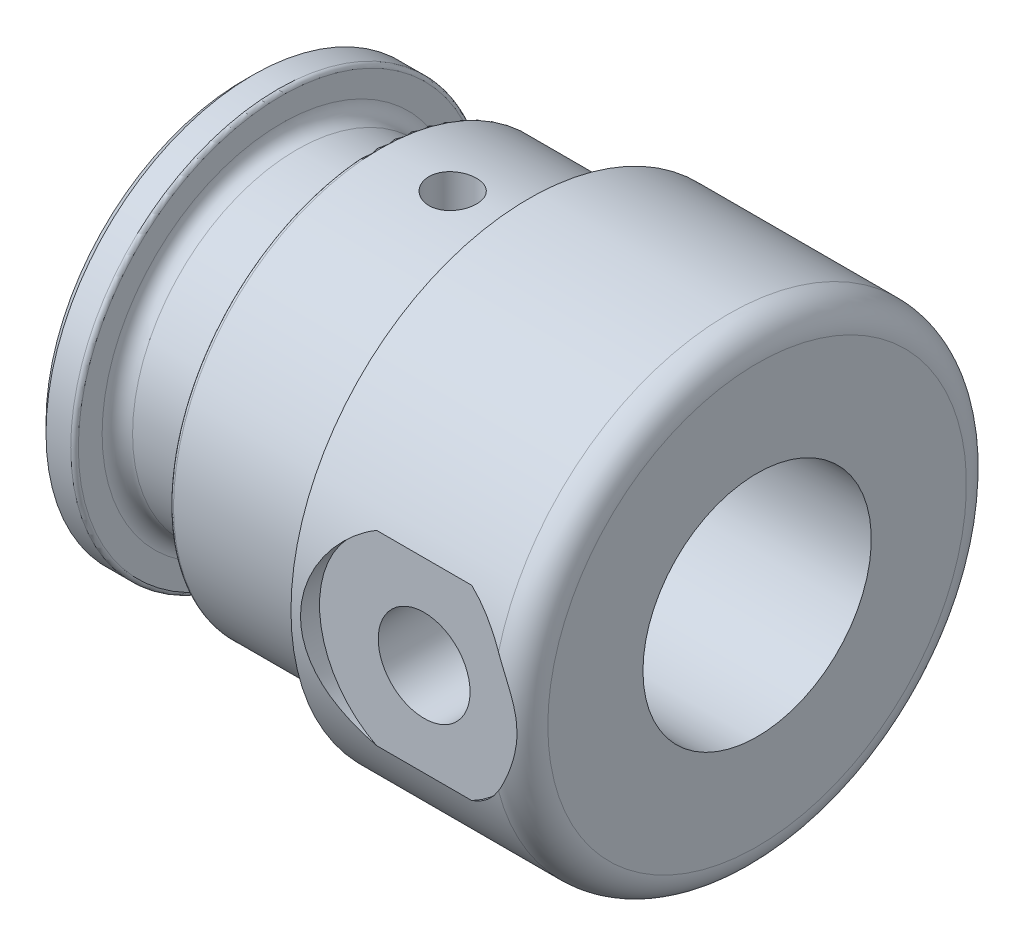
from build123d import *

# Parameters (mm, degrees)
CHAMFER1_SIZE                    = 0.5
FILLET1_R                        = 1.5
FILLET2_R                        = 0.8
FILLET3_R                        = 0.2
CIRPATTERN1_COUNT                = 2
SKETCH10_R                       = 6
CUT_EXTRUDE1_DEPTH               = 27
SKETCH11_R                       = 5.5
CUT_EXTRUDE2_DEPTH               = 1.5
F_10_32_TAPPED_HOLE1_D           = 4.0386
F_10_32_TAPPED_HOLE1_DEPTH       = 13.9624
F_10_32_TAPPED_HOLE1_CBORE_D     = 4.826
F_10_32_TAPPED_HOLE1_CBORE_DEPTH = 10
F_10_32_TAPPED_HOLE1_TIP         = 1.213317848


with BuildPart() as part:
    # Sketch1 → Base-Revolve (revolve)
    with BuildSketch(Plane.XY, mode=Mode.PRIVATE) as base_revolve_sk:
        Polygon((0, 5.55625), (0, 10.875), (2, 10.875), (2, 8.625), (7, 8.625), (7, 10.875), (15, 10.875), (15, 12.5), (27, 12.5), (27, 5.55625), align=None)
    revolve(base_revolve_sk.sketch.rotate(Axis((0, 0, 0), (1, 0, 0)), 90), axis=Axis((0, 0, 0), (1, 0, 0)))

    # Chamfer1
    chamfer1_edges = [part.edges().sort_by_distance(p)[0] for p in [
        (0, 0, -10.875),
    ]]
    chamfer(chamfer1_edges, length=CHAMFER1_SIZE)

    # Sketch8 → M3x0.5 Tapped Hole1 (revolve, cut)
    with BuildSketch(Plane(origin=(11, 11.125, 0), x_dir=(0, 0, 1), z_dir=(1, 0, 0))):
        Polygon((0, 0), (0, 4.751075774), (1.25, 4), (1.25, 0), align=None)
    m3x0_5_tapped_hole1 = revolve(axis=Axis((11, 17.475, 0), (0, -1, 0)), mode=Mode.SUBTRACT)

    # Fillet1
    fillet1_edges = [part.edges().sort_by_distance(p)[0] for p in [
        (27, 0, -12.5),
    ]]
    fillet(fillet1_edges, radius=FILLET1_R)

    # Fillet2
    fillet2_edges = [part.edges().sort_by_distance(p)[0] for p in [
        (2, 0, -8.625),
        (7, 0, -8.625),
    ]]
    fillet(fillet2_edges, radius=FILLET2_R)

    # Fillet3
    fillet3_edges = [part.edges().sort_by_distance(p)[0] for p in [
        (2, 0, -10.875),
        (7, 0, -10.875),
    ]]
    fillet(fillet3_edges, radius=FILLET3_R)

    # CirPattern1: M3x0.5 Tapped Hole1 ×2 about axis
    cirpattern1_axis = Axis((0, 0, 0), (1, 0, 0))
    for i in range(1, CIRPATTERN1_COUNT):
        add(m3x0_5_tapped_hole1.rotate(cirpattern1_axis, i * 360 / CIRPATTERN1_COUNT), mode=Mode.SUBTRACT)

    # Sketch10 → Cut-Extrude1 (cut)
    with BuildSketch(Plane.ZY):
        Circle(SKETCH10_R)
    extrude(amount=-CUT_EXTRUDE1_DEPTH, mode=Mode.SUBTRACT)

    # Sketch11 → Cut-Extrude2 (cut)
    with BuildSketch(Plane.XY.offset(13)):
        with Locations((21, 0)):
            Circle(SKETCH11_R)
    extrude(amount=-CUT_EXTRUDE2_DEPTH, mode=Mode.SUBTRACT)

    # 10-32 Tapped Hole1
    with Locations(Plane.XY.offset(11.5)):
        with Locations((21, 0)):
            CounterBoreHole(F_10_32_TAPPED_HOLE1_D / 2, F_10_32_TAPPED_HOLE1_CBORE_D / 2, F_10_32_TAPPED_HOLE1_CBORE_DEPTH, depth=F_10_32_TAPPED_HOLE1_DEPTH)
            with Locations((0, 0, -(F_10_32_TAPPED_HOLE1_DEPTH + F_10_32_TAPPED_HOLE1_TIP / 2))):  # 118° drill point
                Cone(0, F_10_32_TAPPED_HOLE1_D / 2, F_10_32_TAPPED_HOLE1_TIP, mode=Mode.SUBTRACT)


solid = part.part
